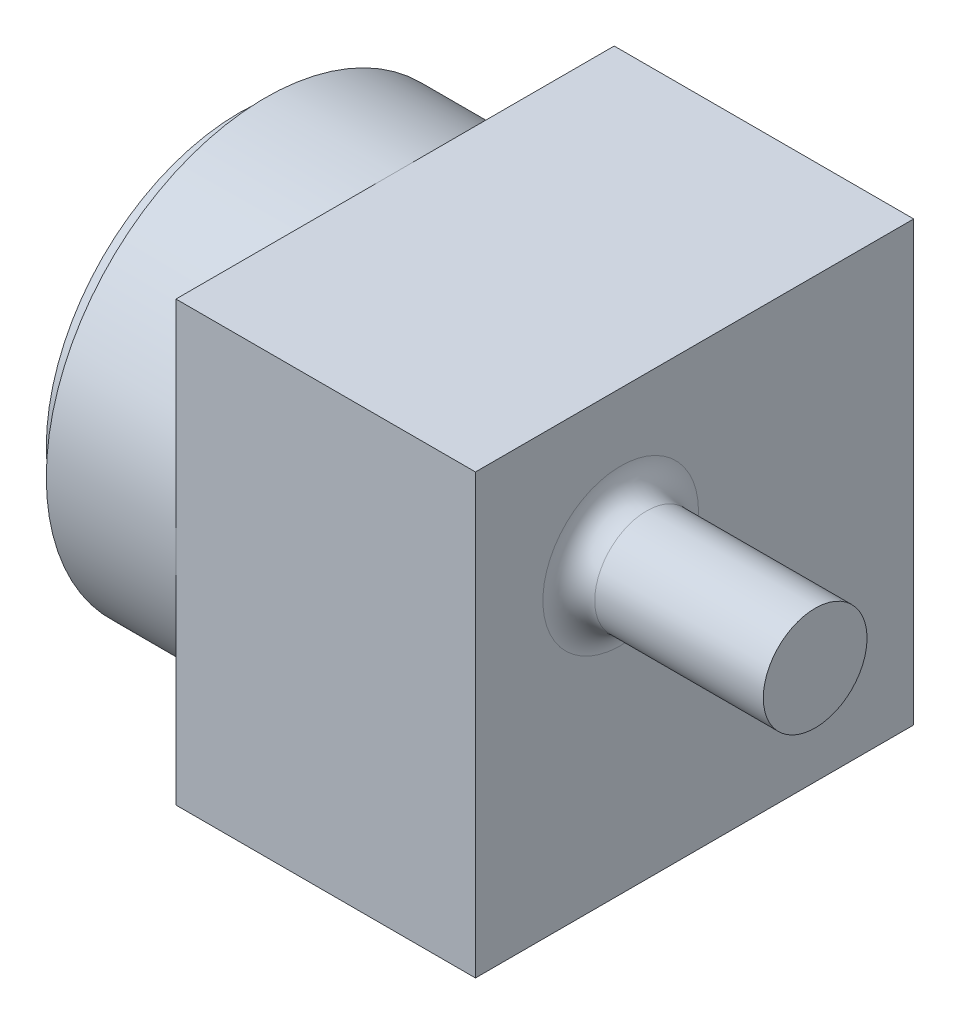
from build123d import *

# Parameters (mm, degrees)
SKETCH1_W        = 8.5852
SKETCH1_H        = 8.5852
MAIN_BODY_DEPTH  = 5.8674
SKETCH2_R        = 4.2926
LENS_BASE_DEPTH  = 2.54
SKETCH3_R        = 3.7846
LENS_SCREW_DEPTH = 0.508
SKETCH4_R        = 2.6924
IRIS_DEPTH       = 0.8382
IRIS_TAPER       = 45
SKETCH5_R        = 0.635
LENS_DEPTH       = 0.254
LENS_DRAFT       = -30
SKETCH6_R        = 1.016
WIRE_2_DEPTH     = 3.81
WIRE_FILLET_R    = 0.508


with BuildPart() as part:
    # Sketch1 → main body (new body)
    with BuildSketch(Plane(origin=(0, 0, 0), x_dir=(0, 0, -1), z_dir=(1, 0, 0))):
        with Locations((0, 4.2926)):
            Rectangle(SKETCH1_W, SKETCH1_H)
    extrude(amount=MAIN_BODY_DEPTH)

    # Sketch2 → lens base (add)
    with BuildSketch(Plane.ZY):
        with Locations((0, 4.2926)):
            Circle(SKETCH2_R)
    extrude(amount=LENS_BASE_DEPTH)

    # Sketch3 → lens screw (add)
    with BuildSketch(Plane.ZY.offset(2.54)):
        with Locations((0, 4.2926)):
            Circle(SKETCH3_R)
    extrude(amount=LENS_SCREW_DEPTH)

    # Sketch4 → iris (add)
    with BuildSketch(Plane.ZY.offset(3.048)):
        with Locations((0, 4.2926)):
            Circle(SKETCH4_R)
    extrude(amount=IRIS_DEPTH, taper=IRIS_TAPER)


with BuildPart() as lens_tool:
    # Sketch5 → lens (with draft: the straight prism first)
    with BuildSketch(Plane.ZY.offset(3.8862)):
        with Locations((0, 4.2926)):
            Circle(SKETCH5_R)
    extrude(amount=-LENS_DEPTH)
    # lens: the draft: its side faces are tilted about the plane it starts from
    lens_sides = [lens_tool.faces().sort_by_distance(p)[0] for p in [
        (-3.7592, 4.2926, -0.635),
    ]]
    draft(lens_sides, Plane.ZY.offset(3.8862), LENS_DRAFT)


with BuildPart() as part_1:
    add(part.part)

    # lens: cut by lens_tool
    add(lens_tool.part, mode=Mode.SUBTRACT)

    # Sketch6 → wire 2 (add)
    with BuildSketch(Plane(origin=(5.8674, 0, 0), x_dir=(0, 0, -1), z_dir=(1, 0, 0))):
        with Locations(Location((-1.4478, 5.7404, 0), (0, 0, 180))):
            Circle(SKETCH6_R)
    extrude(amount=WIRE_2_DEPTH)

    # wire fillet
    wire_fillet_edges = [part_1.edges().sort_by_distance(p)[0] for p in [
        (5.8674, 5.7404, 0.4318),
    ]]
    fillet(wire_fillet_edges, radius=WIRE_FILLET_R)


solid = part_1.part
